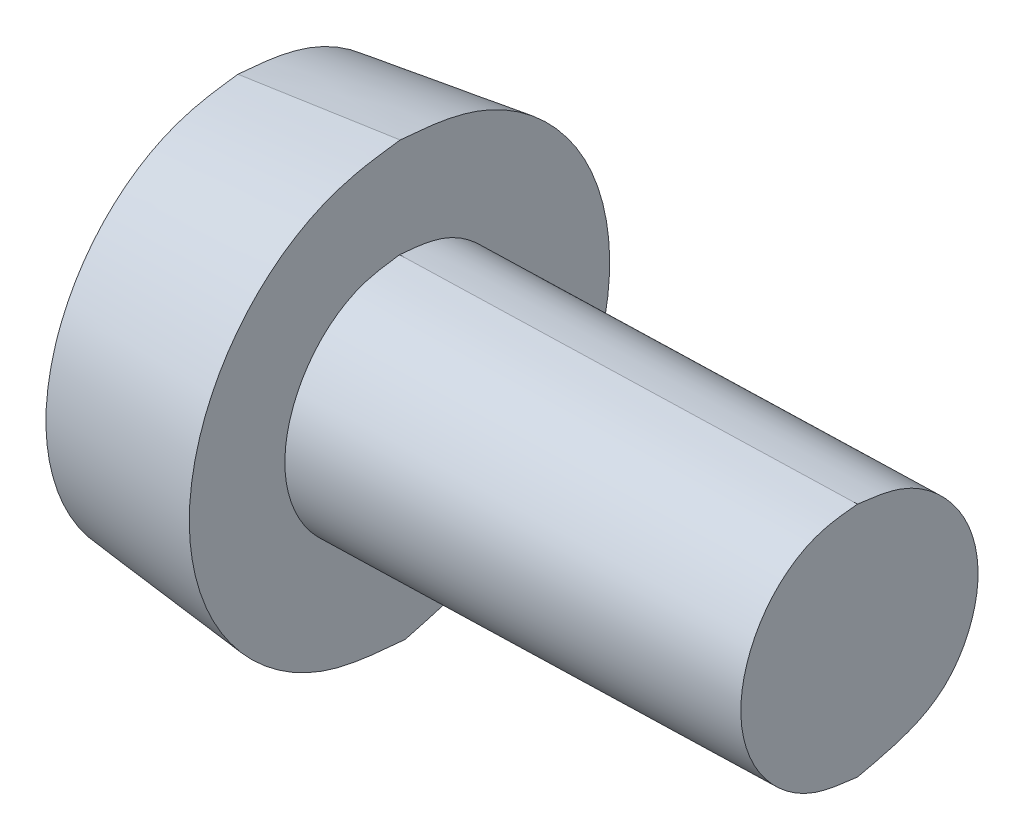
ISO-10303-21;
HEADER;
FILE_DESCRIPTION(('STEP AP214'),'2;1');
FILE_NAME('part.step','',(''),(''),'','','');
FILE_SCHEMA(('AUTOMOTIVE_DESIGN { 1 0 10303 214 1 1 1 1 }'));
ENDSEC;
DATA;
#1=APPLICATION_CONTEXT('core data for automotive mechanical design processes');
#2=APPLICATION_PROTOCOL_DEFINITION('international standard','automotive_design',2000,#1);
#3=PRODUCT_CONTEXT('',#1,'mechanical');
#4=PRODUCT('Part','Part','',(#3));
#5=PRODUCT_RELATED_PRODUCT_CATEGORY('part','',(#4));
#6=PRODUCT_DEFINITION_FORMATION('','',#4);
#7=PRODUCT_DEFINITION_CONTEXT('part definition',#1,'design');
#8=PRODUCT_DEFINITION('design','',#6,#7);
#9=PRODUCT_DEFINITION_SHAPE('','',#8);
#10=(LENGTH_UNIT() NAMED_UNIT(*) SI_UNIT(.MILLI.,.METRE.));
#11=(NAMED_UNIT(*) PLANE_ANGLE_UNIT() SI_UNIT($,.RADIAN.));
#12=(NAMED_UNIT(*) SI_UNIT($,.STERADIAN.) SOLID_ANGLE_UNIT());
#13=UNCERTAINTY_MEASURE_WITH_UNIT(LENGTH_MEASURE(1.E-05),#10,'distance_accuracy_value','');
#14=(GEOMETRIC_REPRESENTATION_CONTEXT(3) GLOBAL_UNCERTAINTY_ASSIGNED_CONTEXT((#13)) GLOBAL_UNIT_ASSIGNED_CONTEXT((#10,
#11,#12)) REPRESENTATION_CONTEXT('',''));
#15=CARTESIAN_POINT('',(0.,0.,0.));
#16=DIRECTION('',(0.,0.,1.));
#17=DIRECTION('',(1.,0.,0.));
#18=AXIS2_PLACEMENT_3D('',#15,#16,#17);
#19=CARTESIAN_POINT('',(18.7517512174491,-15.4,-1.14932372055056));
#20=CARTESIAN_POINT('',(18.7494543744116,-15.4090090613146,-1.22776559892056));
#21=CARTESIAN_POINT('',(18.7448606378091,-15.4270273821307,-1.3846510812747));
#22=CARTESIAN_POINT('',(18.7390201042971,-15.5658081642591,-1.5841172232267));
#23=CARTESIAN_POINT('',(18.7351171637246,-15.7637263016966,-1.71741061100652));
#24=CARTESIAN_POINT('',(18.7342057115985,-15.9218302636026,-1.7485385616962));
#25=CARTESIAN_POINT('',(18.7342044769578,-16.1529925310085,-1.74858072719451));
#26=CARTESIAN_POINT('',(18.7379947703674,-16.4902274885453,-1.61913446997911));
#27=CARTESIAN_POINT('',(18.7471654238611,-16.563406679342,-1.30593793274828));
#28=CARTESIAN_POINT('',(18.7517512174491,-16.6,-1.1493237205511));
#29=B_SPLINE_CURVE_WITH_KNOTS('',3,(#19,#20,#21,#22,#23,#24,#25,#26,#27,#28),.UNSPECIFIED.,.F.,
.F.,(4,1,1,1,1,1,1,4),(0.,0.126177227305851,0.252357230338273,0.378542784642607,
0.504736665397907,0.504851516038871,0.752400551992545,1.),.UNSPECIFIED.);
#30=DIRECTION('',(-0.999571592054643,0.,0.0292682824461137));
#31=VECTOR('',#30,1.);
#32=SURFACE_OF_LINEAR_EXTRUSION('',#29,#31);
#33=DIRECTION('',(-0.999571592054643,0.,0.0292682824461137));
#34=VECTOR('',#33,1.);
#35=CARTESIAN_POINT('',(18.7517512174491,-15.4,-1.14932372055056));
#36=LINE('',#35,#34);
#37=CARTESIAN_POINT('',(-18.2498810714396,-15.4,-0.0658853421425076));
#38=VERTEX_POINT('',#37);
#39=CARTESIAN_POINT('',(-20.5087786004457,-15.4,0.000257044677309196));
#40=VERTEX_POINT('',#39);
#41=EDGE_CURVE('E11',#38,#40,#36,.T.);
#42=ORIENTED_EDGE('',*,*,#41,.F.);
#43=CARTESIAN_POINT('',(-18.2498810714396,-15.4,-0.0658853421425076));
#44=CARTESIAN_POINT('',(-18.2498026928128,-15.4025139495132,-0.0877048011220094));
#45=CARTESIAN_POINT('',(-18.2496842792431,-15.4050127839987,-0.109553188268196));
#46=CARTESIAN_POINT('',(-18.249368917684,-15.4108696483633,-0.15334548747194));
#47=CARTESIAN_POINT('',(-18.2491712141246,-15.4142358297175,-0.175288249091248));
#48=CARTESIAN_POINT('',(-18.2487022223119,-15.4226698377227,-0.218710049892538));
#49=CARTESIAN_POINT('',(-18.2484314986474,-15.4277246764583,-0.240191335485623));
#50=CARTESIAN_POINT('',(-18.2479789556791,-15.4372126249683,-0.271799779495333));
#51=CARTESIAN_POINT('',(-18.2478207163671,-15.4406843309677,-0.282214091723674));
#52=CARTESIAN_POINT('',(-18.2474912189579,-15.4483547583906,-0.302770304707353));
#53=CARTESIAN_POINT('',(-18.2473199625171,-15.4525533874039,-0.312912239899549));
#54=CARTESIAN_POINT('',(-18.2468793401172,-15.4638617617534,-0.337811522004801));
#55=CARTESIAN_POINT('',(-18.2466032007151,-15.4713867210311,-0.352381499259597));
#56=CARTESIAN_POINT('',(-18.2460326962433,-15.4877588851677,-0.380779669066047));
#57=CARTESIAN_POINT('',(-18.245738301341,-15.4966082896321,-0.394606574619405));
#58=CARTESIAN_POINT('',(-18.2448388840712,-15.5248552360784,-0.434823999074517));
#59=CARTESIAN_POINT('',(-18.2442164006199,-15.5459830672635,-0.460017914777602));
#60=CARTESIAN_POINT('',(-18.2429791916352,-15.5917355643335,-0.506707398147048));
#61=CARTESIAN_POINT('',(-18.2423644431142,-15.6163427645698,-0.528220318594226));
#62=CARTESIAN_POINT('',(-18.2411969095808,-15.6686893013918,-0.567111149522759));
#63=CARTESIAN_POINT('',(-18.2406441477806,-15.6964298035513,-0.584487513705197));
#64=CARTESIAN_POINT('',(-18.2398908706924,-15.7407609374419,-0.607407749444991));
#65=CARTESIAN_POINT('',(-18.2396467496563,-15.7564779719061,-0.614678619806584));
#66=CARTESIAN_POINT('',(-18.239199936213,-15.7884962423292,-0.627796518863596));
#67=CARTESIAN_POINT('',(-18.2389972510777,-15.8047975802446,-0.633643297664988));
#68=CARTESIAN_POINT('',(-18.2384581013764,-15.8543855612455,-0.649041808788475));
#69=CARTESIAN_POINT('',(-18.2381902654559,-15.8883720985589,-0.65645986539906));
#70=CARTESIAN_POINT('',(-18.2379490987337,-15.9393694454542,-0.663110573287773));
#71=CARTESIAN_POINT('',(-18.2378951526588,-15.9561259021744,-0.664590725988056));
#72=CARTESIAN_POINT('',(-18.2378391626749,-15.9896857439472,-0.666125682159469));
#73=CARTESIAN_POINT('',(-18.2378370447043,-16.0064890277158,-0.666182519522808));
#74=CARTESIAN_POINT('',(-18.2379131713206,-16.0568263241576,-0.664099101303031));
#75=CARTESIAN_POINT('',(-18.2380739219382,-16.0902826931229,-0.659704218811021));
#76=CARTESIAN_POINT('',(-18.2385712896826,-16.1558170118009,-0.645804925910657));
#77=CARTESIAN_POINT('',(-18.2389066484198,-16.1879030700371,-0.636337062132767));
#78=CARTESIAN_POINT('',(-18.2397226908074,-16.25026815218,-0.612503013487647));
#79=CARTESIAN_POINT('',(-18.2402035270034,-16.2805452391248,-0.598131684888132));
#80=CARTESIAN_POINT('',(-18.2411816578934,-16.3329538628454,-0.567434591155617));
#81=CARTESIAN_POINT('',(-18.2416600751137,-16.3555656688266,-0.551938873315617));
#82=CARTESIAN_POINT('',(-18.2424165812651,-16.3872917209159,-0.52612749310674));
#83=CARTESIAN_POINT('',(-18.2426745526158,-16.3974795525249,-0.51712084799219));
#84=CARTESIAN_POINT('',(-18.2432004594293,-16.4169970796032,-0.498223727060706));
#85=CARTESIAN_POINT('',(-18.2434683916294,-16.4263270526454,-0.488333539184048));
#86=CARTESIAN_POINT('',(-18.2442791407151,-16.4528806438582,-0.457384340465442));
#87=CARTESIAN_POINT('',(-18.244828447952,-16.4686488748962,-0.435061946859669));
#88=CARTESIAN_POINT('',(-18.2458844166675,-16.4966306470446,-0.38826949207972));
#89=CARTESIAN_POINT('',(-18.2463909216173,-16.5088315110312,-0.363792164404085));
#90=CARTESIAN_POINT('',(-18.2472678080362,-16.5292009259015,-0.31656101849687));
#91=CARTESIAN_POINT('',(-18.2476471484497,-16.5376720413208,-0.293933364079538));
#92=CARTESIAN_POINT('',(-18.2483266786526,-16.5530488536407,-0.24818693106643));
#93=CARTESIAN_POINT('',(-18.24862693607,-16.5599558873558,-0.22506859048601));
#94=CARTESIAN_POINT('',(-18.2491330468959,-16.5725879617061,-0.179303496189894));
#95=CARTESIAN_POINT('',(-18.2493415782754,-16.5783434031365,-0.156664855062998));
#96=CARTESIAN_POINT('',(-18.249674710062,-16.5893958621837,-0.11130898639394));
#97=CARTESIAN_POINT('',(-18.2497994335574,-16.5946935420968,-0.0885919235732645));
#98=CARTESIAN_POINT('',(-18.2498810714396,-16.6,-0.0658853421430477));
#99=B_SPLINE_CURVE_WITH_KNOTS('',3,(#43,#44,#45,#46,#47,#48,#49,#50,#51,#52,#53,#54,#55,#56,#57,
#58,#59,#60,#61,#62,#63,#64,#65,#66,#67,#68,#69,#70,#71,#72,#73,#74,#75,#76,#77,#78,#79,#80,#81,
#82,#83,#84,#85,#86,#87,#88,#89,#90,#91,#92,#93,#94,#95,#96,#97,#98),.UNSPECIFIED.,.F.,.F.,(4,2,
2,2,2,2,2,2,2,2,2,2,2,2,2,2,2,2,2,2,2,2,2,2,2,2,2,4),(0.,0.0659367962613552,0.132517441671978,
0.198597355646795,0.23151001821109,0.264418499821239,0.313537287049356,0.362738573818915,
0.460922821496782,0.558630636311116,0.656374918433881,0.708270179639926,0.76017454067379,
0.863930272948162,0.914351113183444,0.964699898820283,1.06541264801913,1.1654094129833,
1.26551139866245,1.34741846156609,1.38817329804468,1.42891490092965,1.51047011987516,
1.59231172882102,1.66472784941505,1.73708184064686,1.80715459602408,1.87712420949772),.UNSPECIFIED.);
#100=CARTESIAN_POINT('',(-18.2498810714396,-16.6,-0.0658853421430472));
#101=VERTEX_POINT('',#100);
#102=EDGE_CURVE('E51',#38,#101,#99,.T.);
#103=ORIENTED_EDGE('',*,*,#102,.T.);
#104=DIRECTION('',(-0.999571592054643,0.,0.0292682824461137));
#105=VECTOR('',#104,1.);
#106=CARTESIAN_POINT('',(18.7517512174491,-16.6,-1.1493237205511));
#107=LINE('',#106,#105);
#108=CARTESIAN_POINT('',(-20.5087786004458,-16.6,0.000257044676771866));
#109=VERTEX_POINT('',#108);
#110=EDGE_CURVE('E172',#101,#109,#107,.T.);
#111=ORIENTED_EDGE('',*,*,#110,.T.);
#112=CARTESIAN_POINT('',(-20.5087786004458,-16.6,0.000257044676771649));
#113=CARTESIAN_POINT('',(-20.5133643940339,-16.563406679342,-0.156357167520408));
#114=CARTESIAN_POINT('',(-20.5225350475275,-16.4902274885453,-0.469553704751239));
#115=CARTESIAN_POINT('',(-20.5263253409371,-16.1529925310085,-0.598999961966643));
#116=CARTESIAN_POINT('',(-20.5263241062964,-15.9218302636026,-0.598957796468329));
#117=CARTESIAN_POINT('',(-20.5254126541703,-15.7637263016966,-0.567829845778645));
#118=CARTESIAN_POINT('',(-20.5215097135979,-15.5658081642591,-0.434536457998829));
#119=CARTESIAN_POINT('',(-20.5156691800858,-15.4270273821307,-0.235070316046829));
#120=CARTESIAN_POINT('',(-20.5110754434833,-15.4090090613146,-0.0781848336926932));
#121=CARTESIAN_POINT('',(-20.5087786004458,-15.4,0.000257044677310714));
#122=B_SPLINE_CURVE_WITH_KNOTS('',3,(#112,#113,#114,#115,#116,#117,#118,#119,#120,#121),
.UNSPECIFIED.,.F.,.F.,(4,1,1,1,1,1,1,4),(0.,0.247599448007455,0.495148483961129,
0.495263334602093,0.621457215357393,0.747642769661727,0.873822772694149,1.),.UNSPECIFIED.);
#123=EDGE_CURVE('E212',#40,#109,#122,.F.);
#124=ORIENTED_EDGE('',*,*,#123,.F.);
#125=EDGE_LOOP('',(#42,#103,#111,#124));
#126=FACE_BOUND('',#125,.T.);
#127=ADVANCED_FACE('F33',(#126),#32,.T.);
#128=CARTESIAN_POINT('',(18.7517512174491,-16.6,-1.14932372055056));
#129=CARTESIAN_POINT('',(18.7540473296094,-16.5909871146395,-1.07090680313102));
#130=CARTESIAN_POINT('',(18.7586396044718,-16.5729611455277,-0.914071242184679));
#131=CARTESIAN_POINT('',(18.7644850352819,-16.4344034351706,-0.714437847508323));
#132=CARTESIAN_POINT('',(18.7683812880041,-16.2360511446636,-0.581372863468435));
#133=CARTESIAN_POINT('',(18.7702569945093,-15.925703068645,-0.517313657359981));
#134=CARTESIAN_POINT('',(18.7662573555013,-15.5973870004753,-0.653909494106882));
#135=CARTESIAN_POINT('',(18.7583223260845,-15.4228617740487,-0.92490694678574));
#136=CARTESIAN_POINT('',(18.7537348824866,-15.4069014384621,-1.08157751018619));
#137=CARTESIAN_POINT('',(18.7517512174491,-15.4,-1.14932372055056));
#138=B_SPLINE_CURVE_WITH_KNOTS('',3,(#128,#129,#130,#131,#132,#133,#134,#135,#136,#137),
.UNSPECIFIED.,.F.,.F.,(4,1,1,1,1,1,1,4),(0.,0.12554276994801,0.251088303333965,
0.376639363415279,0.502198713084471,0.748637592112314,0.891307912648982,1.),.UNSPECIFIED.);
#139=DIRECTION('',(-0.999571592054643,0.,0.0292682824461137));
#140=VECTOR('',#139,1.);
#141=SURFACE_OF_LINEAR_EXTRUSION('',#138,#140);
#142=ORIENTED_EDGE('',*,*,#110,.F.);
#143=CARTESIAN_POINT('',(-18.2498810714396,-16.6,-0.0658853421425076));
#144=CARTESIAN_POINT('',(-18.249961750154,-16.5974366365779,-0.0436565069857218));
#145=CARTESIAN_POINT('',(-18.2500010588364,-16.5948889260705,-0.0213958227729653));
#146=CARTESIAN_POINT('',(-18.2499988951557,-16.588884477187,0.0232246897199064));
#147=CARTESIAN_POINT('',(-18.2499566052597,-16.5854188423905,0.0455832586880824));
#148=CARTESIAN_POINT('',(-18.2497922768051,-16.576686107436,0.0898109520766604));
#149=CARTESIAN_POINT('',(-18.2496708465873,-16.5714328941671,0.111682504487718));
#150=CARTESIAN_POINT('',(-18.2494364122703,-16.5615343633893,0.143824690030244));
#151=CARTESIAN_POINT('',(-18.2493497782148,-16.5579076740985,0.154407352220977));
#152=CARTESIAN_POINT('',(-18.249161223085,-16.5498978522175,0.175281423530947));
#153=CARTESIAN_POINT('',(-18.2490593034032,-16.5455147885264,0.185572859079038));
#154=CARTESIAN_POINT('',(-18.2487914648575,-16.533858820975,0.210547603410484));
#155=CARTESIAN_POINT('',(-18.2486178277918,-16.5261900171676,0.225047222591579));
#156=CARTESIAN_POINT('',(-18.2482476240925,-16.5095426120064,0.253295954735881));
#157=CARTESIAN_POINT('',(-18.2480510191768,-16.5005618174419,0.267043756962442));
#158=CARTESIAN_POINT('',(-18.2474369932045,-16.4719429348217,0.307003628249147));
#159=CARTESIAN_POINT('',(-18.2469944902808,-16.4505914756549,0.332008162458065));
#160=CARTESIAN_POINT('',(-18.2460942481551,-16.4043930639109,0.378255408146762));
#161=CARTESIAN_POINT('',(-18.2456365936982,-16.3795636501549,0.399515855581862));
#162=CARTESIAN_POINT('',(-18.2447556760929,-16.3268407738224,0.437903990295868));
#163=CARTESIAN_POINT('',(-18.2443324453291,-16.2989444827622,0.4550278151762));
#164=CARTESIAN_POINT('',(-18.2435459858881,-16.2387683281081,0.485572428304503));
#165=CARTESIAN_POINT('',(-18.2431888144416,-16.2063192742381,0.498661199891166));
#166=CARTESIAN_POINT('',(-18.2426227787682,-16.1396124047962,0.518959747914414));
#167=CARTESIAN_POINT('',(-18.2424138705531,-16.1053551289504,0.52617126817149));
#168=CARTESIAN_POINT('',(-18.2422385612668,-16.0541778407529,0.532197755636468));
#169=CARTESIAN_POINT('',(-18.2422025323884,-16.0375149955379,0.533429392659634));
#170=CARTESIAN_POINT('',(-18.2421740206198,-16.0041460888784,0.534403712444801));
#171=CARTESIAN_POINT('',(-18.2421815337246,-15.9874400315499,0.534146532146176));
#172=CARTESIAN_POINT('',(-18.2422681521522,-15.9374551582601,0.531186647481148));
#173=CARTESIAN_POINT('',(-18.2424112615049,-15.9042873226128,0.526298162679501));
#174=CARTESIAN_POINT('',(-18.2428335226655,-15.8399984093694,0.511446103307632));
#175=CARTESIAN_POINT('',(-18.2431092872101,-15.8088471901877,0.501608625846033));
#176=CARTESIAN_POINT('',(-18.2437611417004,-15.7483584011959,0.477312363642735));
#177=CARTESIAN_POINT('',(-18.2441373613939,-15.7190232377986,0.462847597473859));
#178=CARTESIAN_POINT('',(-18.2449904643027,-15.660126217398,0.427968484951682));
#179=CARTESIAN_POINT('',(-18.2454736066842,-15.6308253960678,0.40710914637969));
#180=CARTESIAN_POINT('',(-18.246452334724,-15.5764496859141,0.360576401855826));
#181=CARTESIAN_POINT('',(-18.2469478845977,-15.5513639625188,0.334915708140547));
#182=CARTESIAN_POINT('',(-18.2478613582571,-15.5073925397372,0.28063307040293));
#183=CARTESIAN_POINT('',(-18.2482818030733,-15.488274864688,0.252201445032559));
#184=CARTESIAN_POINT('',(-18.2488299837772,-15.4638609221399,0.20720083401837));
#185=CARTESIAN_POINT('',(-18.2489992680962,-15.4564207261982,0.191768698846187));
#186=CARTESIAN_POINT('',(-18.2493033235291,-15.4431444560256,0.160236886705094));
#187=CARTESIAN_POINT('',(-18.2494381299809,-15.4373067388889,0.144137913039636));
#188=CARTESIAN_POINT('',(-18.2496626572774,-15.4275359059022,0.112069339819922));
#189=CARTESIAN_POINT('',(-18.2497539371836,-15.423537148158,0.0961193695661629));
#190=CARTESIAN_POINT('',(-18.249895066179,-15.4167097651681,0.0639513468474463));
#191=CARTESIAN_POINT('',(-18.2499448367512,-15.4138833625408,0.0477328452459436));
#192=CARTESIAN_POINT('',(-18.2500007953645,-15.4090235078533,0.0152660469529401));
#193=CARTESIAN_POINT('',(-18.2500071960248,-15.4069862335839,-0.000981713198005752));
#194=CARTESIAN_POINT('',(-18.2499765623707,-15.4033016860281,-0.0334512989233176));
#195=CARTESIAN_POINT('',(-18.24993971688,-15.4016527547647,-0.0496729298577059));
#196=CARTESIAN_POINT('',(-18.2498810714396,-15.4,-0.0658853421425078));
#197=B_SPLINE_CURVE_WITH_KNOTS('',3,(#143,#144,#145,#146,#147,#148,#149,#150,#151,#152,#153,
#154,#155,#156,#157,#158,#159,#160,#161,#162,#163,#164,#165,#166,#167,#168,#169,#170,#171,#172,
#173,#174,#175,#176,#177,#178,#179,#180,#181,#182,#183,#184,#185,#186,#187,#188,#189,#190,#191,
#192,#193,#194,#195,#196),.UNSPECIFIED.,.F.,.F.,(4,2,2,2,2,2,2,2,2,2,2,2,2,2,2,2,2,2,2,2,2,2,2,
2,2,2,4),(0.,0.0671780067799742,0.135032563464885,0.202371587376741,0.235906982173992,
0.269439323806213,0.318568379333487,0.367780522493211,0.46595482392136,0.563650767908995,
0.661437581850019,0.765890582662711,0.870312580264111,0.920381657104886,0.970446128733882,
1.07050863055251,1.16814176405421,1.26590161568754,1.37326874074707,1.48035551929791,
1.58252026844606,1.63384867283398,1.68512425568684,1.73439153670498,1.78375179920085,
1.83286989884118,1.88177433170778),.UNSPECIFIED.);
#198=EDGE_CURVE('E44',#101,#38,#197,.T.);
#199=ORIENTED_EDGE('',*,*,#198,.T.);
#200=ORIENTED_EDGE('',*,*,#41,.T.);
#201=CARTESIAN_POINT('',(-20.5087786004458,-15.4,0.000257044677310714));
#202=CARTESIAN_POINT('',(-20.5067949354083,-15.4069014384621,0.0680032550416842));
#203=CARTESIAN_POINT('',(-20.5022074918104,-15.4228617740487,0.224673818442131));
#204=CARTESIAN_POINT('',(-20.4942724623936,-15.5973870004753,0.49567127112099));
#205=CARTESIAN_POINT('',(-20.4902728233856,-15.925703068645,0.63226710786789));
#206=CARTESIAN_POINT('',(-20.4921485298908,-16.2360511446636,0.568207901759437));
#207=CARTESIAN_POINT('',(-20.496044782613,-16.4344034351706,0.435142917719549));
#208=CARTESIAN_POINT('',(-20.5018902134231,-16.5729611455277,0.235509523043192));
#209=CARTESIAN_POINT('',(-20.5064824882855,-16.5909871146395,0.0786739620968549));
#210=CARTESIAN_POINT('',(-20.5087786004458,-16.6,0.000257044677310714));
#211=B_SPLINE_CURVE_WITH_KNOTS('',3,(#201,#202,#203,#204,#205,#206,#207,#208,#209,#210),
.UNSPECIFIED.,.F.,.F.,(4,1,1,1,1,1,1,4),(0.,0.108692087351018,0.251362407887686,
0.497801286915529,0.623360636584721,0.748911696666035,0.87445723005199,1.),.UNSPECIFIED.);
#212=EDGE_CURVE('E94',#109,#40,#211,.F.);
#213=ORIENTED_EDGE('',*,*,#212,.F.);
#214=EDGE_LOOP('',(#142,#199,#200,#213));
#215=FACE_BOUND('',#214,.T.);
#216=ADVANCED_FACE('F35',(#215),#141,.T.);
#217=CARTESIAN_POINT('',(0.,-16.,0.));
#218=DIRECTION('',(0.,1.,0.));
#219=DIRECTION('',(0.,0.,1.));
#220=AXIS2_PLACEMENT_3D('',#217,#218,#219);
#221=CYLINDRICAL_SURFACE('',#220,18.25);
#222=ORIENTED_EDGE('',*,*,#198,.F.);
#223=ORIENTED_EDGE('',*,*,#102,.F.);
#224=EDGE_LOOP('',(#222,#223));
#225=FACE_BOUND('',#224,.T.);
#226=ADVANCED_FACE('F119',(#225),#221,.F.);
#227=CARTESIAN_POINT('',(-20.3564507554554,-14.8784775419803,-0.00956605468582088));
#228=CARTESIAN_POINT('',(-20.3585157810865,-14.8865772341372,-0.0800908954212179));
#229=CARTESIAN_POINT('',(-20.3606034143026,-14.8938807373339,-0.151387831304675));
#230=CARTESIAN_POINT('',(-20.3647436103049,-14.920059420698,-0.292783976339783));
#231=CARTESIAN_POINT('',(-20.3667953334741,-14.9388440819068,-0.362854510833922));
#232=CARTESIAN_POINT('',(-20.3727673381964,-15.019849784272,-0.566810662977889));
#233=CARTESIAN_POINT('',(-20.3763158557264,-15.1025989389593,-0.687999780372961));
#234=CARTESIAN_POINT('',(-20.3823172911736,-15.3068413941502,-0.89296105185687));
#235=CARTESIAN_POINT('',(-20.3847579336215,-15.4291977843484,-0.976313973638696));
#236=CARTESIAN_POINT('',(-20.3880604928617,-15.6943174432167,-1.08910311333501));
#237=CARTESIAN_POINT('',(-20.3889557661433,-15.8393793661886,-1.11967852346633));
#238=CARTESIAN_POINT('',(-20.3890813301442,-16.1276255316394,-1.12396679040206));
#239=CARTESIAN_POINT('',(-20.3882872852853,-16.2732423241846,-1.09684853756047));
#240=CARTESIAN_POINT('',(-20.3852424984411,-16.5428096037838,-0.992862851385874));
#241=CARTESIAN_POINT('',(-20.3829833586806,-16.6681186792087,-0.915708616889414));
#242=CARTESIAN_POINT('',(-20.3770316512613,-16.8759295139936,-0.712445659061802));
#243=CARTESIAN_POINT('',(-20.3733569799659,-16.9542379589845,-0.586948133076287));
#244=CARTESIAN_POINT('',(-20.3654543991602,-17.0627365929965,-0.317058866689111));
#245=CARTESIAN_POINT('',(-20.3613339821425,-17.0924718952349,-0.176338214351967));
#246=CARTESIAN_POINT('',(-20.3572725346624,-17.1248809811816,-0.0376314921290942));
#247=CARTESIAN_POINT('',(-21.620497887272,-15.0327996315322,0.0451702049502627));
#248=CARTESIAN_POINT('',(-21.6226011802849,-15.0410494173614,-0.0266615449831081));
#249=CARTESIAN_POINT('',(-21.624580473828,-15.0481323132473,-0.0942584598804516));
#250=CARTESIAN_POINT('',(-21.6282431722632,-15.071291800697,-0.219347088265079));
#251=CARTESIAN_POINT('',(-21.6300000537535,-15.0875131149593,-0.279348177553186));
#252=CARTESIAN_POINT('',(-21.6350220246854,-15.1556327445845,-0.450858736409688));
#253=CARTESIAN_POINT('',(-21.6380798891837,-15.226499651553,-0.555291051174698));
#254=CARTESIAN_POINT('',(-21.6432677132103,-15.4030526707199,-0.732465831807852));
#255=CARTESIAN_POINT('',(-21.6453773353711,-15.5090573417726,-0.804513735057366));
#256=CARTESIAN_POINT('',(-21.6482058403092,-15.7361214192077,-0.901112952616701));
#257=CARTESIAN_POINT('',(-21.6489845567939,-15.862447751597,-0.927707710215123));
#258=CARTESIAN_POINT('',(-21.6490920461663,-16.1091826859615,-0.931378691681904));
#259=CARTESIAN_POINT('',(-21.6484071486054,-16.2354012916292,-0.90798804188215));
#260=CARTESIAN_POINT('',(-21.6457709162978,-16.4687974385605,-0.817955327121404));
#261=CARTESIAN_POINT('',(-21.6438076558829,-16.5766516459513,-0.750905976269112));
#262=CARTESIAN_POINT('',(-21.6388395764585,-16.7501192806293,-0.581235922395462));
#263=CARTESIAN_POINT('',(-21.6357364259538,-16.8168457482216,-0.475256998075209));
#264=CARTESIAN_POINT('',(-21.6288159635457,-16.91186010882,-0.238909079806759));
#265=CARTESIAN_POINT('',(-21.6249250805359,-16.9407326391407,-0.106027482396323));
#266=CARTESIAN_POINT('',(-21.6208041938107,-16.9736160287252,0.0347092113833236));
#267=B_SPLINE_SURFACE_WITH_KNOTS('',1,3,((#227,#228,#229,#230,#231,#232,#233,#234,#235,#236,
#237,#238,#239,#240,#241,#242,#243,#244,#245,#246),(#247,#248,#249,#250,#251,#252,#253,#254,
#255,#256,#257,#258,#259,#260,#261,#262,#263,#264,#265,#266)),.UNSPECIFIED.,.F.,.F.,.F.,(2,2),
(4,2,2,2,2,2,2,2,2,4),(0.,1.),(0.,0.0625,0.125,0.25,0.375,0.5,0.625,0.75,0.875,1.),.UNSPECIFIED.);
#268=CARTESIAN_POINT('',(-20.508872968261,-14.8970861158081,-0.00296580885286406));
#269=CARTESIAN_POINT('',(-20.5109426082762,-14.9052039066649,-0.0736482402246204));
#270=CARTESIAN_POINT('',(-20.5130171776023,-14.912480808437,-0.144499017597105));
#271=CARTESIAN_POINT('',(-20.51709979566,-14.9382954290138,-0.283928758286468));
#272=CARTESIAN_POINT('',(-20.5191159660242,-14.9567709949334,-0.352785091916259));
#273=CARTESIAN_POINT('',(-20.5249734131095,-15.0362228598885,-0.552828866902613));
#274=CARTESIAN_POINT('',(-20.5284627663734,-15.1175392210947,-0.671997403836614));
#275=CARTESIAN_POINT('',(-20.5343660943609,-15.3184428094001,-0.87360810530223));
#276=CARTESIAN_POINT('',(-20.5367668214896,-15.4388274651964,-0.95559783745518));
#277=CARTESIAN_POINT('',(-20.5400122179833,-15.6993582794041,-1.06643475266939));
#278=CARTESIAN_POINT('',(-20.540893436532,-15.842161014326,-1.09653016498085));
#279=CARTESIAN_POINT('',(-20.5410168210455,-16.1254016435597,-1.10074399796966));
#280=CARTESIAN_POINT('',(-20.5402359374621,-16.2686793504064,-1.07407522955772));
#281=CARTESIAN_POINT('',(-20.537240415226,-16.5338850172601,-0.971772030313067));
#282=CARTESIAN_POINT('',(-20.5350169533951,-16.6570893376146,-0.895836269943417));
#283=CARTESIAN_POINT('',(-20.5291838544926,-16.860758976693,-0.69662403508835));
#284=CARTESIAN_POINT('',(-20.5255780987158,-16.9376708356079,-0.573480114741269));
#285=CARTESIAN_POINT('',(-20.5177939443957,-17.044543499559,-0.307635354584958));
#286=CARTESIAN_POINT('',(-20.5137012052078,-17.0741747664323,-0.167859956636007));
#287=CARTESIAN_POINT('',(-20.5096325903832,-17.1066410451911,-0.028908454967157));
#288=B_SPLINE_CURVE_WITH_KNOTS('',3,(#268,#269,#270,#271,#272,#273,#274,#275,#276,#277,#278,
#279,#280,#281,#282,#283,#284,#285,#286,#287),.UNSPECIFIED.,.F.,.F.,(4,2,2,2,2,2,2,2,2,4),(0.,
0.0625,0.125,0.25,0.375,0.5,0.625,0.75,0.875,1.),.UNSPECIFIED.);
#289=CARTESIAN_POINT('',(-20.508872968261,-14.8970861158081,-0.00296580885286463));
#290=VERTEX_POINT('',#289);
#291=CARTESIAN_POINT('',(-20.5096325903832,-17.1066410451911,-0.0289084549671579));
#292=VERTEX_POINT('',#291);
#293=EDGE_CURVE('E79',#290,#292,#288,.T.);
#294=CARTESIAN_POINT('',(-21.3091224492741,-17.0071156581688,0.000223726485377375));
#295=CARTESIAN_POINT('',(-21.1758739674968,-17.0237025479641,-0.00462922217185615));
#296=CARTESIAN_POINT('',(-21.0426255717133,-17.040289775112,-0.00948337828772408));
#297=CARTESIAN_POINT('',(-20.776128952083,-17.0734649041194,-0.0191941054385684));
#298=CARTESIAN_POINT('',(-20.6428807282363,-17.0900528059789,-0.0240506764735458));
#299=CARTESIAN_POINT('',(-20.5096325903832,-17.1066410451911,-0.0289084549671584));
#300=B_SPLINE_CURVE_WITH_KNOTS('',3,(#294,#295,#296,#297,#298,#299),.UNSPECIFIED.,.F.,.F.,(4,2,
4),(0.,0.40309366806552,0.806187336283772),.UNSPECIFIED.);
#301=CARTESIAN_POINT('',(-21.3091224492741,-17.0071156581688,0.000223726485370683));
#302=VERTEX_POINT('',#301);
#303=EDGE_CURVE('E88',#302,#292,#300,.T.);
#304=CARTESIAN_POINT('',(-21.3085117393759,-14.9958817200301,0.0210807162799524));
#305=CARTESIAN_POINT('',(-21.3092252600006,-14.9986937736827,-0.00328746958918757));
#306=CARTESIAN_POINT('',(-21.3099394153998,-15.0013991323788,-0.027677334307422));
#307=CARTESIAN_POINT('',(-21.3113717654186,-15.0072517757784,-0.076595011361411));
#308=CARTESIAN_POINT('',(-21.3120899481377,-15.0104023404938,-0.101122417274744));
#309=CARTESIAN_POINT('',(-21.313523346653,-15.0177841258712,-0.150075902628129));
#310=CARTESIAN_POINT('',(-21.3142385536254,-15.022017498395,-0.174501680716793));
#311=CARTESIAN_POINT('',(-21.3156561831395,-15.0320556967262,-0.222916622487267));
#312=CARTESIAN_POINT('',(-21.3163586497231,-15.0378531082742,-0.246907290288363));
#313=CARTESIAN_POINT('',(-21.317747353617,-15.0511972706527,-0.294334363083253));
#314=CARTESIAN_POINT('',(-21.3184336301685,-15.0587391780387,-0.317772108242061));
#315=CARTESIAN_POINT('',(-21.319783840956,-15.0757997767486,-0.363884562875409));
#316=CARTESIAN_POINT('',(-21.3204478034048,-15.0853158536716,-0.386560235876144));
#317=CARTESIAN_POINT('',(-21.3218317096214,-15.1074812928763,-0.433823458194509));
#318=CARTESIAN_POINT('',(-21.3225483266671,-15.1203732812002,-0.458297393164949));
#319=CARTESIAN_POINT('',(-21.3239457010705,-15.1482929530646,-0.506020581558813));
#320=CARTESIAN_POINT('',(-21.3246264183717,-15.16332295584,-0.529268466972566));
#321=CARTESIAN_POINT('',(-21.32660650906,-15.2112451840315,-0.596892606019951));
#322=CARTESIAN_POINT('',(-21.3278471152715,-15.2470236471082,-0.639261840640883));
#323=CARTESIAN_POINT('',(-21.330140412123,-15.3248156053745,-0.717582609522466));
#324=CARTESIAN_POINT('',(-21.3311935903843,-15.3668123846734,-0.753550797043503));
#325=CARTESIAN_POINT('',(-21.3326150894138,-15.4336994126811,-0.802097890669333));
#326=CARTESIAN_POINT('',(-21.3330627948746,-15.4566606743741,-0.817387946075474));
#327=CARTESIAN_POINT('',(-21.3339022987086,-15.5037501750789,-0.846058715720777));
#328=CARTESIAN_POINT('',(-21.3342941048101,-15.5278782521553,-0.859439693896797));
#329=CARTESIAN_POINT('',(-21.3350313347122,-15.5781456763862,-0.884617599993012));
#330=CARTESIAN_POINT('',(-21.3353743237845,-15.604326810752,-0.896331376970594));
#331=CARTESIAN_POINT('',(-21.3359908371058,-15.657629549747,-0.917386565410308));
#332=CARTESIAN_POINT('',(-21.3362643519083,-15.6847512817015,-0.926727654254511));
#333=CARTESIAN_POINT('',(-21.3367430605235,-15.7396715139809,-0.943076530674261));
#334=CARTESIAN_POINT('',(-21.3369482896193,-15.767469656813,-0.950085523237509));
#335=CARTESIAN_POINT('',(-21.3372898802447,-15.8235560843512,-0.961751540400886));
#336=CARTESIAN_POINT('',(-21.3374262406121,-15.8518443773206,-0.966408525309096));
#337=CARTESIAN_POINT('',(-21.3376268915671,-15.908203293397,-0.9732611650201));
#338=CARTESIAN_POINT('',(-21.3376924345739,-15.9362686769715,-0.975499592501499));
#339=CARTESIAN_POINT('',(-21.3377517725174,-15.9924846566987,-0.977526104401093));
#340=CARTESIAN_POINT('',(-21.3377455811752,-16.0206352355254,-0.977314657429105));
#341=CARTESIAN_POINT('',(-21.3376617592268,-16.0768183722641,-0.974451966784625));
#342=CARTESIAN_POINT('',(-21.337584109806,-16.1048508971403,-0.971800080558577));
#343=CARTESIAN_POINT('',(-21.337361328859,-16.1605985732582,-0.964191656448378));
#344=CARTESIAN_POINT('',(-21.3372161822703,-16.1883136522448,-0.959234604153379));
#345=CARTESIAN_POINT('',(-21.3366851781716,-16.2703801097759,-0.941099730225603));
#346=CARTESIAN_POINT('',(-21.3362031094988,-16.3240387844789,-0.924636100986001));
#347=CARTESIAN_POINT('',(-21.3349909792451,-16.4280596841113,-0.88323937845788));
#348=CARTESIAN_POINT('',(-21.3342607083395,-16.4784190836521,-0.858299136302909));
#349=CARTESIAN_POINT('',(-21.3329694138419,-16.551015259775,-0.814198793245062));
#350=CARTESIAN_POINT('',(-21.3324963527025,-16.5751120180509,-0.798042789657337));
#351=CARTESIAN_POINT('',(-21.3314856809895,-16.621680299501,-0.763526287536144));
#352=CARTESIAN_POINT('',(-21.3309480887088,-16.6441522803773,-0.745166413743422));
#353=CARTESIAN_POINT('',(-21.3300959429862,-16.6763616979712,-0.716063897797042));
#354=CARTESIAN_POINT('',(-21.3298048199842,-16.686831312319,-0.706121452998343));
#355=CARTESIAN_POINT('',(-21.3292065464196,-16.7072212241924,-0.685689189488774));
#356=CARTESIAN_POINT('',(-21.3288993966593,-16.7171415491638,-0.675199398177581));
#357=CARTESIAN_POINT('',(-21.3279557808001,-16.7460542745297,-0.642972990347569));
#358=CARTESIAN_POINT('',(-21.3272969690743,-16.7642051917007,-0.620473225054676));
#359=CARTESIAN_POINT('',(-21.3260329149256,-16.7956986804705,-0.577303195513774));
#360=CARTESIAN_POINT('',(-21.3254342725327,-16.8093549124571,-0.556858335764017));
#361=CARTESIAN_POINT('',(-21.3242080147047,-16.8350475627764,-0.514979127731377));
#362=CARTESIAN_POINT('',(-21.3235804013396,-16.8470840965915,-0.493544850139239));
#363=CARTESIAN_POINT('',(-21.322297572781,-16.8696615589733,-0.449733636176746));
#364=CARTESIAN_POINT('',(-21.3216422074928,-16.8801924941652,-0.427351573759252));
#365=CARTESIAN_POINT('',(-21.3203120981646,-16.8996928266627,-0.381925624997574));
#366=CARTESIAN_POINT('',(-21.3196373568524,-16.9086624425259,-0.358881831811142));
#367=CARTESIAN_POINT('',(-21.3181497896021,-16.9267927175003,-0.308078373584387));
#368=CARTESIAN_POINT('',(-21.3173342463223,-16.9356892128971,-0.280225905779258));
#369=CARTESIAN_POINT('',(-21.3156918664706,-16.9522097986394,-0.224135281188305));
#370=CARTESIAN_POINT('',(-21.3148650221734,-16.9598329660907,-0.195896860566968));
#371=CARTESIAN_POINT('',(-21.3132190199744,-16.9741995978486,-0.139682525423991));
#372=CARTESIAN_POINT('',(-21.3123999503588,-16.980955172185,-0.111709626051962));
#373=CARTESIAN_POINT('',(-21.310761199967,-16.9941553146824,-0.0557429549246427));
#374=CARTESIAN_POINT('',(-21.3099415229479,-17.0006004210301,-0.0277493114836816));
#375=CARTESIAN_POINT('',(-21.3091224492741,-17.0071156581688,0.000223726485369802));
#376=B_SPLINE_CURVE_WITH_KNOTS('',3,(#304,#305,#306,#307,#308,#309,#310,#311,#312,#313,#314,
#315,#316,#317,#318,#319,#320,#321,#322,#323,#324,#325,#326,#327,#328,#329,#330,#331,#332,#333,
#334,#335,#336,#337,#338,#339,#340,#341,#342,#343,#344,#345,#346,#347,#348,#349,#350,#351,#352,
#353,#354,#355,#356,#357,#358,#359,#360,#361,#362,#363,#364,#365,#366,#367,#368,#369,#370,#371,
#372,#373,#374,#375),.UNSPECIFIED.,.F.,.F.,(4,2,2,2,2,2,2,2,2,2,2,2,2,2,2,2,2,2,2,2,2,2,2,2,2,2,
2,2,2,2,2,2,2,2,2,4),(0.,0.073637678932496,0.147849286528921,0.222209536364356,
0.296223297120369,0.37003398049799,0.443747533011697,0.526641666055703,0.609626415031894,
0.775226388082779,0.940389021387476,1.02308289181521,1.10576531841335,1.19170440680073,
1.27765517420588,1.36356146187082,1.44946919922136,1.53383143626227,1.61817753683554,
1.70254585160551,1.78693300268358,1.95456082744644,2.12233037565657,2.2092725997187,
2.29619023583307,2.3394970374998,2.38280167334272,2.46938371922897,2.54309202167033,
2.61679506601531,2.69096661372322,2.765127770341,2.85283018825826,2.94059589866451,
3.02695924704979,3.11316706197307),.UNSPECIFIED.);
#377=CARTESIAN_POINT('',(-21.3085117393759,-14.9958817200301,0.0210807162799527));
#378=VERTEX_POINT('',#377);
#379=EDGE_CURVE('E85',#378,#302,#376,.T.);
#380=CARTESIAN_POINT('',(-21.3085117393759,-14.9958817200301,0.0210807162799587));
#381=CARTESIAN_POINT('',(-21.1752385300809,-14.9794163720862,0.0170732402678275));
#382=CARTESIAN_POINT('',(-21.0419653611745,-14.9629507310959,0.0130656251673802));
#383=CARTESIAN_POINT('',(-20.7754191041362,-14.9300188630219,0.00505011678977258));
#384=CARTESIAN_POINT('',(-20.6421460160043,-14.9135526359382,0.00104222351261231));
#385=CARTESIAN_POINT('',(-20.508872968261,-14.8970861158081,-0.00296580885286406));
#386=B_SPLINE_CURVE_WITH_KNOTS('',3,(#380,#381,#382,#383,#384,#385),.UNSPECIFIED.,.F.,.F.,(4,2,
4),(0.,0.403038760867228,0.806077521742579),.UNSPECIFIED.);
#387=EDGE_CURVE('E95',#378,#290,#386,.T.);
#388=ORIENTED_EDGE('',*,*,#293,.T.);
#389=ORIENTED_EDGE('',*,*,#303,.F.);
#390=ORIENTED_EDGE('',*,*,#379,.F.);
#391=ORIENTED_EDGE('',*,*,#387,.T.);
#392=EDGE_LOOP('',(#388,#389,#390,#391));
#393=FACE_BOUND('',#392,.T.);
#394=ADVANCED_FACE('F98',(#393),#267,.F.);
#395=CARTESIAN_POINT('',(-20.3570931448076,-17.1252484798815,-0.0312362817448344));
#396=CARTESIAN_POINT('',(-20.3528816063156,-17.1087171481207,0.112596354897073));
#397=CARTESIAN_POINT('',(-20.3485848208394,-17.0946174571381,0.259340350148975));
#398=CARTESIAN_POINT('',(-20.3403594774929,-16.9910456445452,0.540252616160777));
#399=CARTESIAN_POINT('',(-20.3366951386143,-16.9088230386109,0.665397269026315));
#400=CARTESIAN_POINT('',(-20.3304901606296,-16.703071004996,0.877309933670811));
#401=CARTESIAN_POINT('',(-20.3279679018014,-16.5788912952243,0.963450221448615));
#402=CARTESIAN_POINT('',(-20.324536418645,-16.3092466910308,1.08064237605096));
#403=CARTESIAN_POINT('',(-20.323597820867,-16.1611359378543,1.11269740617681));
#404=CARTESIAN_POINT('',(-20.3235207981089,-15.8668080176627,1.11532789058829));
#405=CARTESIAN_POINT('',(-20.3243775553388,-15.7185893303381,1.08606788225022));
#406=CARTESIAN_POINT('',(-20.3276296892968,-15.4446851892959,0.975000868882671));
#407=CARTESIAN_POINT('',(-20.3300007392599,-15.3191939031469,0.894024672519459));
#408=CARTESIAN_POINT('',(-20.3360824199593,-15.1061613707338,0.686322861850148));
#409=CARTESIAN_POINT('',(-20.3396941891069,-15.0218838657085,0.562973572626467));
#410=CARTESIAN_POINT('',(-20.3457437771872,-14.9382676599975,0.356367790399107));
#411=CARTESIAN_POINT('',(-20.3478232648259,-14.918698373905,0.285349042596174));
#412=CARTESIAN_POINT('',(-20.3520670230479,-14.892394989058,0.140416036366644));
#413=CARTESIAN_POINT('',(-20.3542186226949,-14.8858350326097,0.066934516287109));
#414=CARTESIAN_POINT('',(-20.3563405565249,-14.878452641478,-0.00553385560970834));
#415=CARTESIAN_POINT('',(-21.6221623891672,-16.970929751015,-0.0119307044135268));
#416=CARTESIAN_POINT('',(-21.6178544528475,-16.9540200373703,0.135194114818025));
#417=CARTESIAN_POINT('',(-21.6140283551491,-16.9403181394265,0.265863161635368));
#418=CARTESIAN_POINT('',(-21.6071611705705,-16.8538465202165,0.500391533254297));
#419=CARTESIAN_POINT('',(-21.6039893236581,-16.7833458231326,0.608716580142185));
#420=CARTESIAN_POINT('',(-21.5986292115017,-16.6056092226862,0.791775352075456));
#421=CARTESIAN_POINT('',(-21.5964441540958,-16.4978280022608,0.86639952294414));
#422=CARTESIAN_POINT('',(-21.5934994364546,-16.2664333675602,0.966967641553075));
#423=CARTESIAN_POINT('',(-21.5926886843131,-16.1381497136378,0.994656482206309));
#424=CARTESIAN_POINT('',(-21.5926229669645,-15.8870170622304,0.996900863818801));
#425=CARTESIAN_POINT('',(-21.5933586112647,-15.7586363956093,0.971777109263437));
#426=CARTESIAN_POINT('',(-21.5961750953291,-15.5214245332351,0.875588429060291));
#427=CARTESIAN_POINT('',(-21.5982263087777,-15.4129191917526,0.805535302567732));
#428=CARTESIAN_POINT('',(-21.6034666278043,-15.2293584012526,0.626567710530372));
#429=CARTESIAN_POINT('',(-21.6065718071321,-15.1572799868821,0.52051949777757));
#430=CARTESIAN_POINT('',(-21.6116880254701,-15.0865640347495,0.345790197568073));
#431=CARTESIAN_POINT('',(-21.6134532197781,-15.0698758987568,0.285505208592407));
#432=CARTESIAN_POINT('',(-21.6171607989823,-15.0468957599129,0.158883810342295));
#433=CARTESIAN_POINT('',(-21.6191906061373,-15.0405051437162,0.0895617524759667));
#434=CARTESIAN_POINT('',(-21.6213514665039,-15.0329873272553,0.0157639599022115));
#435=B_SPLINE_SURFACE_WITH_KNOTS('',1,3,((#395,#396,#397,#398,#399,#400,#401,#402,#403,#404,
#405,#406,#407,#408,#409,#410,#411,#412,#413,#414),(#415,#416,#417,#418,#419,#420,#421,#422,
#423,#424,#425,#426,#427,#428,#429,#430,#431,#432,#433,#434)),.UNSPECIFIED.,.F.,.F.,.F.,(2,2),
(4,2,2,2,2,2,2,2,2,4),(0.,1.),(0.,0.125,0.25,0.375,0.5,0.625,0.75,0.875,0.9375,1.),.UNSPECIFIED.);
#436=CARTESIAN_POINT('',(-20.5096325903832,-17.1066410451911,-0.0289084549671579));
#437=CARTESIAN_POINT('',(-20.5054094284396,-17.0900640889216,0.115321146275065));
#438=CARTESIAN_POINT('',(-20.5011693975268,-17.0760123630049,0.260126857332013));
#439=CARTESIAN_POINT('',(-20.4931078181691,-16.9745024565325,0.535446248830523));
#440=CARTESIAN_POINT('',(-20.489502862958,-16.89369325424,0.6585628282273));
#441=CARTESIAN_POINT('',(-20.4833997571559,-16.691319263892,0.866996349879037));
#442=CARTESIAN_POINT('',(-20.4809181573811,-16.5691168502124,0.951748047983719));
#443=CARTESIAN_POINT('',(-20.4775453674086,-16.3040843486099,1.06693571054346));
#444=CARTESIAN_POINT('',(-20.4766221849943,-16.1583643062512,1.09846427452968));
#445=CARTESIAN_POINT('',(-20.4765465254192,-15.8692447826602,1.10104820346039));
#446=CARTESIAN_POINT('',(-20.4773886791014,-15.7234181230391,1.07228693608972));
#447=CARTESIAN_POINT('',(-20.4805882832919,-15.4539382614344,0.963013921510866));
#448=CARTESIAN_POINT('',(-20.4829207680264,-15.3304951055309,0.883354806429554));
#449=CARTESIAN_POINT('',(-20.4889009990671,-15.1210162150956,0.679117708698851));
#450=CARTESIAN_POINT('',(-20.4924516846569,-15.0382096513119,0.557854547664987));
#451=CARTESIAN_POINT('',(-20.4983887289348,-14.9561489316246,0.355092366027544));
#452=CARTESIAN_POINT('',(-20.5004303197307,-14.9369270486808,0.285367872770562));
#453=CARTESIAN_POINT('',(-20.5046094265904,-14.9110243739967,0.142642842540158));
#454=CARTESIAN_POINT('',(-20.5067463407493,-14.9044848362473,0.0696628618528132));
#455=CARTESIAN_POINT('',(-20.508872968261,-14.8970861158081,-0.00296580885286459));
#456=B_SPLINE_CURVE_WITH_KNOTS('',3,(#436,#437,#438,#439,#440,#441,#442,#443,#444,#445,#446,
#447,#448,#449,#450,#451,#452,#453,#454,#455),.UNSPECIFIED.,.F.,.F.,(4,2,2,2,2,2,2,2,2,4),(0.,
0.125,0.25,0.375,0.5,0.625,0.75,0.875,0.9375,1.),.UNSPECIFIED.);
#457=EDGE_CURVE('E74',#292,#290,#456,.T.);
#458=CARTESIAN_POINT('',(-21.3091224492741,-17.0071156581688,0.000223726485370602));
#459=CARTESIAN_POINT('',(-21.3083773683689,-17.0041920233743,0.0256697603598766));
#460=CARTESIAN_POINT('',(-21.3076320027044,-17.0013023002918,0.051125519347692));
#461=CARTESIAN_POINT('',(-21.3061353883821,-16.9951123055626,0.102237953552));
#462=CARTESIAN_POINT('',(-21.3053841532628,-16.9918083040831,0.127894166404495));
#463=CARTESIAN_POINT('',(-21.3038828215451,-16.9843394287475,0.179167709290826));
#464=CARTESIAN_POINT('',(-21.3031327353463,-16.9801719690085,0.204784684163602));
#465=CARTESIAN_POINT('',(-21.3016427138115,-16.9704574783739,0.255671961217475));
#466=CARTESIAN_POINT('',(-21.300902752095,-16.9649153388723,0.280943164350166));
#467=CARTESIAN_POINT('',(-21.2994398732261,-16.9518983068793,0.330903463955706));
#468=CARTESIAN_POINT('',(-21.2987169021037,-16.9444308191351,0.355594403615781));
#469=CARTESIAN_POINT('',(-21.2976517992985,-16.9314495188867,0.391969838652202));
#470=CARTESIAN_POINT('',(-21.2973002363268,-16.9268296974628,0.403976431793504));
#471=CARTESIAN_POINT('',(-21.2966032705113,-16.9170752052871,0.427779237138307));
#472=CARTESIAN_POINT('',(-21.2962578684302,-16.9119404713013,0.43957542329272));
#473=CARTESIAN_POINT('',(-21.2951803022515,-16.8949611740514,0.476376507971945));
#474=CARTESIAN_POINT('',(-21.2944603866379,-16.882193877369,0.500963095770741));
#475=CARTESIAN_POINT('',(-21.2930557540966,-16.8545072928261,0.548934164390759));
#476=CARTESIAN_POINT('',(-21.2923710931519,-16.8395847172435,0.572316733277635));
#477=CARTESIAN_POINT('',(-21.2910430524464,-16.8078198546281,0.617672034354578));
#478=CARTESIAN_POINT('',(-21.2903995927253,-16.7909814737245,0.639647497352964));
#479=CARTESIAN_POINT('',(-21.2891560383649,-16.7555708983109,0.682117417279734));
#480=CARTESIAN_POINT('',(-21.2885559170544,-16.7369997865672,0.702612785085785));
#481=CARTESIAN_POINT('',(-21.2868281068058,-16.6789537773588,0.761621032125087));
#482=CARTESIAN_POINT('',(-21.2857685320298,-16.6370392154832,0.797807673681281));
#483=CARTESIAN_POINT('',(-21.2843363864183,-16.5703017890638,0.846718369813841));
#484=CARTESIAN_POINT('',(-21.2838848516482,-16.5473879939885,0.862139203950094));
#485=CARTESIAN_POINT('',(-21.2830370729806,-16.5003884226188,0.891092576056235));
#486=CARTESIAN_POINT('',(-21.2826408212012,-16.4763028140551,0.904625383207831));
#487=CARTESIAN_POINT('',(-21.2818916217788,-16.4259960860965,0.930212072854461));
#488=CARTESIAN_POINT('',(-21.2815413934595,-16.3997276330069,0.942173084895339));
#489=CARTESIAN_POINT('',(-21.2809103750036,-16.3462303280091,0.963723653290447));
#490=CARTESIAN_POINT('',(-21.2806295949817,-16.3190013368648,0.973312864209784));
#491=CARTESIAN_POINT('',(-21.2801376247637,-16.2638457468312,0.990114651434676));
#492=CARTESIAN_POINT('',(-21.2799263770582,-16.2359197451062,0.997329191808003));
#493=CARTESIAN_POINT('',(-21.2795747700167,-16.1795523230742,1.00933729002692));
#494=CARTESIAN_POINT('',(-21.2794344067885,-16.1511109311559,1.01413098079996));
#495=CARTESIAN_POINT('',(-21.2792296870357,-16.0947039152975,1.02112257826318));
#496=CARTESIAN_POINT('',(-21.2791633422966,-16.0667467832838,1.02338838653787));
#497=CARTESIAN_POINT('',(-21.279103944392,-16.0107438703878,1.02541694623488));
#498=CARTESIAN_POINT('',(-21.2791108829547,-15.9826980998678,1.02517998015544));
#499=CARTESIAN_POINT('',(-21.2791960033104,-15.9267332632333,1.02227294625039));
#500=CARTESIAN_POINT('',(-21.2792741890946,-15.8988142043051,1.01960274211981));
#501=CARTESIAN_POINT('',(-21.2794982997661,-15.8432998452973,1.01194890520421));
#502=CARTESIAN_POINT('',(-21.2796442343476,-15.8157045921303,1.0069649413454));
#503=CARTESIAN_POINT('',(-21.2801736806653,-15.7347473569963,0.988883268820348));
#504=CARTESIAN_POINT('',(-21.2806507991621,-15.6820644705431,0.972588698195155));
#505=CARTESIAN_POINT('',(-21.281842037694,-15.5799134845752,0.931905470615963));
#506=CARTESIAN_POINT('',(-21.2825563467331,-15.5304479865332,0.907510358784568));
#507=CARTESIAN_POINT('',(-21.2842573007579,-15.4330832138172,0.849419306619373));
#508=CARTESIAN_POINT('',(-21.2852580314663,-15.3854689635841,0.815242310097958));
#509=CARTESIAN_POINT('',(-21.2874833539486,-15.2969313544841,0.739243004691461));
#510=CARTESIAN_POINT('',(-21.2887075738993,-15.255997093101,0.697433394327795));
#511=CARTESIAN_POINT('',(-21.2913151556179,-15.1832110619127,0.608379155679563));
#512=CARTESIAN_POINT('',(-21.2926932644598,-15.1511419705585,0.56131392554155));
#513=CARTESIAN_POINT('',(-21.2948708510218,-15.1097832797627,0.486944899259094));
#514=CARTESIAN_POINT('',(-21.2956165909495,-15.0971041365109,0.461476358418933));
#515=CARTESIAN_POINT('',(-21.2971390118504,-15.0741820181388,0.409482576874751));
#516=CARTESIAN_POINT('',(-21.29791566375,-15.0639368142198,0.382958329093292));
#517=CARTESIAN_POINT('',(-21.2994955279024,-15.0460192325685,0.329002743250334));
#518=CARTESIAN_POINT('',(-21.3002987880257,-15.0383518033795,0.301569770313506));
#519=CARTESIAN_POINT('',(-21.3015158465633,-15.0285755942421,0.26000473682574));
#520=CARTESIAN_POINT('',(-21.3019239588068,-15.0256023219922,0.246066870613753));
#521=CARTESIAN_POINT('',(-21.3027433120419,-15.0202099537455,0.218084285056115));
#522=CARTESIAN_POINT('',(-21.303154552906,-15.0177908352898,0.204039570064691));
#523=CARTESIAN_POINT('',(-21.3039776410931,-15.0134181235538,0.175929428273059));
#524=CARTESIAN_POINT('',(-21.3043894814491,-15.011462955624,0.161864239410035));
#525=CARTESIAN_POINT('',(-21.3052143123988,-15.007851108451,0.13369457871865));
#526=CARTESIAN_POINT('',(-21.3056273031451,-15.0061944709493,0.119590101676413));
#527=CARTESIAN_POINT('',(-21.3064521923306,-15.0030645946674,0.0914184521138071));
#528=CARTESIAN_POINT('',(-21.3068640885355,-15.0015906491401,0.0773513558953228));
#529=CARTESIAN_POINT('',(-21.3076879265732,-14.9987115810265,0.0492156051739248));
#530=CARTESIAN_POINT('',(-21.308099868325,-14.9973064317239,0.035146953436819));
#531=CARTESIAN_POINT('',(-21.3085117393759,-14.9958817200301,0.0210807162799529));
#532=B_SPLINE_CURVE_WITH_KNOTS('',3,(#458,#459,#460,#461,#462,#463,#464,#465,#466,#467,#468,
#469,#470,#471,#472,#473,#474,#475,#476,#477,#478,#479,#480,#481,#482,#483,#484,#485,#486,#487,
#488,#489,#490,#491,#492,#493,#494,#495,#496,#497,#498,#499,#500,#501,#502,#503,#504,#505,#506,
#507,#508,#509,#510,#511,#512,#513,#514,#515,#516,#517,#518,#519,#520,#521,#522,#523,#524,#525,
#526,#527,#528,#529,#530,#531),.UNSPECIFIED.,.F.,.F.,(4,2,2,2,2,2,2,2,2,2,2,2,2,2,2,2,2,2,2,2,2,
2,2,2,2,2,2,2,2,2,2,2,2,2,2,2,4),(0.,0.0768827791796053,0.154515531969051,0.232384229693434,
0.309979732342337,0.387281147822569,0.425876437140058,0.464476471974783,0.547488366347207,
0.63062825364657,0.713601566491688,0.796523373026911,0.961816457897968,1.0446212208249,
1.12741416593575,1.21389941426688,1.30039725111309,1.38682336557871,1.47324473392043,
1.55728422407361,1.64131422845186,1.72534894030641,1.80939568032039,1.97407590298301,
2.13888766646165,2.31387000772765,2.48856383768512,2.65849165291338,2.74376982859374,
2.82896961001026,2.91433202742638,2.95709549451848,2.99985722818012,3.04247168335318,
3.08509209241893,3.12754210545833,3.1699755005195),.UNSPECIFIED.);
#533=EDGE_CURVE('E90',#302,#378,#532,.T.);
#534=ORIENTED_EDGE('',*,*,#457,.T.);
#535=ORIENTED_EDGE('',*,*,#387,.F.);
#536=ORIENTED_EDGE('',*,*,#533,.F.);
#537=ORIENTED_EDGE('',*,*,#303,.T.);
#538=EDGE_LOOP('',(#534,#535,#536,#537));
#539=FACE_BOUND('',#538,.T.);
#540=ADVANCED_FACE('F89',(#539),#435,.F.);
#541=CARTESIAN_POINT('',(-21.3406124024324,-15.9837813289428,-1.07522245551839));
#542=DIRECTION('',(-0.999571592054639,-1.56528672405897E-12,0.0292682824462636));
#543=DIRECTION('',(0.0292682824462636,0.,0.999571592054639));
#544=AXIS2_PLACEMENT_3D('',#541,#542,#543);
#545=PLANE('',#544);
#546=ORIENTED_EDGE('',*,*,#379,.T.);
#547=ORIENTED_EDGE('',*,*,#533,.T.);
#548=EDGE_LOOP('',(#546,#547));
#549=FACE_BOUND('',#548,.T.);
#550=ADVANCED_FACE('F162',(#549),#545,.T.);
#551=CARTESIAN_POINT('',(-20.5409551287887,-15.9837813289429,-1.09863708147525));
#552=DIRECTION('',(-0.999571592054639,-1.56528672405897E-12,0.0292682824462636));
#553=DIRECTION('',(0.0292682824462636,0.,0.999571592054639));
#554=AXIS2_PLACEMENT_3D('',#551,#552,#553);
#555=PLANE('',#554);
#556=ORIENTED_EDGE('',*,*,#123,.T.);
#557=ORIENTED_EDGE('',*,*,#212,.T.);
#558=EDGE_LOOP('',(#556,#557));
#559=FACE_BOUND('',#558,.T.);
#560=ORIENTED_EDGE('',*,*,#293,.F.);
#561=ORIENTED_EDGE('',*,*,#457,.F.);
#562=EDGE_LOOP('',(#560,#561));
#563=FACE_BOUND('',#562,.T.);
#564=ADVANCED_FACE('F77',(#559,#563),#555,.F.);
#565=CLOSED_SHELL('',(#127,#216,#226,#394,#540,#550,#564));
#566=MANIFOLD_SOLID_BREP('B2',#565);
#567=ADVANCED_BREP_SHAPE_REPRESENTATION('',(#18,#566),#14);
#568=SHAPE_DEFINITION_REPRESENTATION(#9,#567);
ENDSEC;
END-ISO-10303-21;
